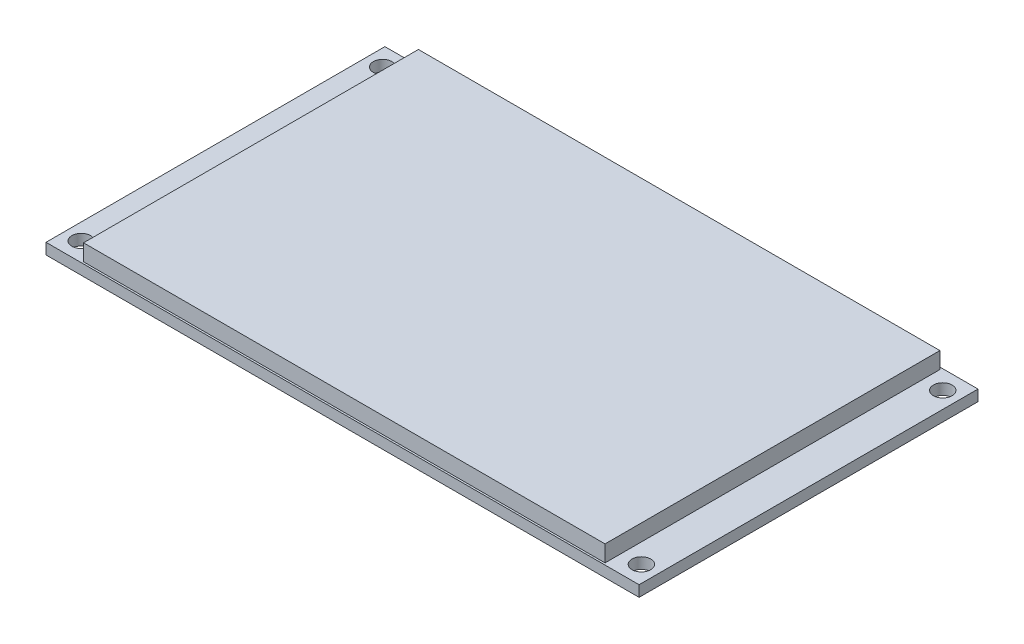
ISO-10303-21;
HEADER;
FILE_DESCRIPTION(('STEP AP214'),'2;1');
FILE_NAME('part.step','',(''),(''),'','','');
FILE_SCHEMA(('AUTOMOTIVE_DESIGN { 1 0 10303 214 1 1 1 1 }'));
ENDSEC;
DATA;
#1=APPLICATION_CONTEXT('core data for automotive mechanical design processes');
#2=APPLICATION_PROTOCOL_DEFINITION('international standard','automotive_design',2000,#1);
#3=PRODUCT_CONTEXT('',#1,'mechanical');
#4=PRODUCT('Part','Part','',(#3));
#5=PRODUCT_RELATED_PRODUCT_CATEGORY('part','',(#4));
#6=PRODUCT_DEFINITION_FORMATION('','',#4);
#7=PRODUCT_DEFINITION_CONTEXT('part definition',#1,'design');
#8=PRODUCT_DEFINITION('design','',#6,#7);
#9=PRODUCT_DEFINITION_SHAPE('','',#8);
#10=(LENGTH_UNIT() NAMED_UNIT(*) SI_UNIT(.MILLI.,.METRE.));
#11=(NAMED_UNIT(*) PLANE_ANGLE_UNIT() SI_UNIT($,.RADIAN.));
#12=(NAMED_UNIT(*) SI_UNIT($,.STERADIAN.) SOLID_ANGLE_UNIT());
#13=UNCERTAINTY_MEASURE_WITH_UNIT(LENGTH_MEASURE(1.E-05),#10,'distance_accuracy_value','');
#14=(GEOMETRIC_REPRESENTATION_CONTEXT(3) GLOBAL_UNCERTAINTY_ASSIGNED_CONTEXT((#13)) GLOBAL_UNIT_ASSIGNED_CONTEXT((#10,
#11,#12)) REPRESENTATION_CONTEXT('',''));
#15=CARTESIAN_POINT('',(0.,0.,0.));
#16=DIRECTION('',(0.,0.,1.));
#17=DIRECTION('',(1.,0.,0.));
#18=AXIS2_PLACEMENT_3D('',#15,#16,#17);
#19=CARTESIAN_POINT('',(54.02,2.,-30.87));
#20=DIRECTION('',(-1.,0.,0.));
#21=DIRECTION('',(0.,0.,1.));
#22=AXIS2_PLACEMENT_3D('',#19,#20,#21);
#23=PLANE('',#22);
#24=DIRECTION('',(0.,0.,-1.));
#25=VECTOR('',#24,1.);
#26=CARTESIAN_POINT('',(54.02,0.,-30.87));
#27=LINE('',#26,#25);
#28=CARTESIAN_POINT('',(54.02,0.,30.87));
#29=VERTEX_POINT('',#28);
#30=CARTESIAN_POINT('',(54.02,0.,-30.87));
#31=VERTEX_POINT('',#30);
#32=EDGE_CURVE('E122',#29,#31,#27,.T.);
#33=ORIENTED_EDGE('',*,*,#32,.T.);
#34=DIRECTION('',(0.,-1.,0.));
#35=VECTOR('',#34,1.);
#36=CARTESIAN_POINT('',(54.02,2.,-30.87));
#37=LINE('',#36,#35);
#38=CARTESIAN_POINT('',(54.02,2.,-30.87));
#39=VERTEX_POINT('',#38);
#40=EDGE_CURVE('E11',#39,#31,#37,.T.);
#41=ORIENTED_EDGE('',*,*,#40,.F.);
#42=DIRECTION('',(0.,0.,-1.));
#43=VECTOR('',#42,1.);
#44=CARTESIAN_POINT('',(54.02,2.,-30.87));
#45=LINE('',#44,#43);
#46=CARTESIAN_POINT('',(54.02,2.,30.87));
#47=VERTEX_POINT('',#46);
#48=EDGE_CURVE('E131',#47,#39,#45,.T.);
#49=ORIENTED_EDGE('',*,*,#48,.F.);
#50=DIRECTION('',(0.,-1.,0.));
#51=VECTOR('',#50,1.);
#52=CARTESIAN_POINT('',(54.02,2.,30.87));
#53=LINE('',#52,#51);
#54=EDGE_CURVE('E140',#47,#29,#53,.T.);
#55=ORIENTED_EDGE('',*,*,#54,.T.);
#56=EDGE_LOOP('',(#33,#41,#49,#55));
#57=FACE_BOUND('',#56,.T.);
#58=ADVANCED_FACE('F38',(#57),#23,.F.);
#59=CARTESIAN_POINT('',(-54.02,2.,-30.87));
#60=DIRECTION('',(0.,0.,1.));
#61=DIRECTION('',(1.,0.,0.));
#62=AXIS2_PLACEMENT_3D('',#59,#60,#61);
#63=PLANE('',#62);
#64=DIRECTION('',(-1.,0.,0.));
#65=VECTOR('',#64,1.);
#66=CARTESIAN_POINT('',(-54.02,0.,-30.87));
#67=LINE('',#66,#65);
#68=CARTESIAN_POINT('',(-54.02,0.,-30.87));
#69=VERTEX_POINT('',#68);
#70=EDGE_CURVE('E125',#31,#69,#67,.T.);
#71=ORIENTED_EDGE('',*,*,#70,.T.);
#72=DIRECTION('',(0.,-1.,0.));
#73=VECTOR('',#72,1.);
#74=CARTESIAN_POINT('',(-54.02,2.,-30.87));
#75=LINE('',#74,#73);
#76=CARTESIAN_POINT('',(-54.02,2.,-30.87));
#77=VERTEX_POINT('',#76);
#78=EDGE_CURVE('E45',#77,#69,#75,.T.);
#79=ORIENTED_EDGE('',*,*,#78,.F.);
#80=DIRECTION('',(-1.,0.,0.));
#81=VECTOR('',#80,1.);
#82=CARTESIAN_POINT('',(-54.02,2.,-30.87));
#83=LINE('',#82,#81);
#84=EDGE_CURVE('E134',#39,#77,#83,.T.);
#85=ORIENTED_EDGE('',*,*,#84,.F.);
#86=ORIENTED_EDGE('',*,*,#40,.T.);
#87=EDGE_LOOP('',(#71,#79,#85,#86));
#88=FACE_BOUND('',#87,.T.);
#89=ADVANCED_FACE('F171',(#88),#63,.F.);
#90=CARTESIAN_POINT('',(-54.02,2.,-30.87));
#91=DIRECTION('',(1.,0.,0.));
#92=DIRECTION('',(0.,0.,-1.));
#93=AXIS2_PLACEMENT_3D('',#90,#91,#92);
#94=PLANE('',#93);
#95=DIRECTION('',(0.,0.,1.));
#96=VECTOR('',#95,1.);
#97=CARTESIAN_POINT('',(-54.02,0.,-30.87));
#98=LINE('',#97,#96);
#99=CARTESIAN_POINT('',(-54.02,0.,30.87));
#100=VERTEX_POINT('',#99);
#101=EDGE_CURVE('E143',#69,#100,#98,.T.);
#102=ORIENTED_EDGE('',*,*,#101,.T.);
#103=DIRECTION('',(0.,-1.,0.));
#104=VECTOR('',#103,1.);
#105=CARTESIAN_POINT('',(-54.02,2.,30.87));
#106=LINE('',#105,#104);
#107=CARTESIAN_POINT('',(-54.02,2.,30.87));
#108=VERTEX_POINT('',#107);
#109=EDGE_CURVE('E148',#108,#100,#106,.T.);
#110=ORIENTED_EDGE('',*,*,#109,.F.);
#111=DIRECTION('',(0.,0.,1.));
#112=VECTOR('',#111,1.);
#113=CARTESIAN_POINT('',(-54.02,2.,-30.87));
#114=LINE('',#113,#112);
#115=EDGE_CURVE('E137',#77,#108,#114,.T.);
#116=ORIENTED_EDGE('',*,*,#115,.F.);
#117=ORIENTED_EDGE('',*,*,#78,.T.);
#118=EDGE_LOOP('',(#102,#110,#116,#117));
#119=FACE_BOUND('',#118,.T.);
#120=ADVANCED_FACE('F155',(#119),#94,.F.);
#121=CARTESIAN_POINT('',(-54.02,2.,30.87));
#122=DIRECTION('',(0.,0.,-1.));
#123=DIRECTION('',(-1.,0.,0.));
#124=AXIS2_PLACEMENT_3D('',#121,#122,#123);
#125=PLANE('',#124);
#126=DIRECTION('',(1.,0.,0.));
#127=VECTOR('',#126,1.);
#128=CARTESIAN_POINT('',(-54.02,0.,30.87));
#129=LINE('',#128,#127);
#130=EDGE_CURVE('E135',#100,#29,#129,.T.);
#131=ORIENTED_EDGE('',*,*,#130,.T.);
#132=ORIENTED_EDGE('',*,*,#54,.F.);
#133=DIRECTION('',(1.,0.,0.));
#134=VECTOR('',#133,1.);
#135=CARTESIAN_POINT('',(-54.02,2.,30.87));
#136=LINE('',#135,#134);
#137=EDGE_CURVE('E139',#108,#47,#136,.T.);
#138=ORIENTED_EDGE('',*,*,#137,.F.);
#139=ORIENTED_EDGE('',*,*,#109,.T.);
#140=EDGE_LOOP('',(#131,#132,#138,#139));
#141=FACE_BOUND('',#140,.T.);
#142=ADVANCED_FACE('F164',(#141),#125,.F.);
#143=CARTESIAN_POINT('',(0.,2.,0.));
#144=DIRECTION('',(0.,1.,0.));
#145=DIRECTION('',(0.,0.,1.));
#146=AXIS2_PLACEMENT_3D('',#143,#144,#145);
#147=PLANE('',#146);
#148=CARTESIAN_POINT('',(-51.02,2.,-27.45));
#149=DIRECTION('',(0.,1.,0.));
#150=DIRECTION('',(0.,0.,1.));
#151=AXIS2_PLACEMENT_3D('',#148,#149,#150);
#152=CIRCLE('',#151,1.69999999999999);
#153=CARTESIAN_POINT('',(-51.02,2.,-25.75));
#154=VERTEX_POINT('',#153);
#155=EDGE_CURVE('E224',#154,#154,#152,.T.);
#156=ORIENTED_EDGE('',*,*,#155,.F.);
#157=EDGE_LOOP('',(#156));
#158=FACE_BOUND('',#157,.T.);
#159=CARTESIAN_POINT('',(-51.02,2.,27.45));
#160=DIRECTION('',(0.,1.,0.));
#161=DIRECTION('',(0.,0.,1.));
#162=AXIS2_PLACEMENT_3D('',#159,#160,#161);
#163=CIRCLE('',#162,1.69999999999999);
#164=CARTESIAN_POINT('',(-51.02,2.,29.15));
#165=VERTEX_POINT('',#164);
#166=EDGE_CURVE('E226',#165,#165,#163,.T.);
#167=ORIENTED_EDGE('',*,*,#166,.F.);
#168=EDGE_LOOP('',(#167));
#169=FACE_BOUND('',#168,.T.);
#170=CARTESIAN_POINT('',(51.02,2.,-27.45));
#171=DIRECTION('',(0.,1.,0.));
#172=DIRECTION('',(0.,0.,1.));
#173=AXIS2_PLACEMENT_3D('',#170,#171,#172);
#174=CIRCLE('',#173,1.69999999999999);
#175=CARTESIAN_POINT('',(51.02,2.,-25.75));
#176=VERTEX_POINT('',#175);
#177=EDGE_CURVE('E234',#176,#176,#174,.T.);
#178=ORIENTED_EDGE('',*,*,#177,.F.);
#179=EDGE_LOOP('',(#178));
#180=FACE_BOUND('',#179,.T.);
#181=CARTESIAN_POINT('',(51.02,2.,27.45));
#182=DIRECTION('',(0.,1.,0.));
#183=DIRECTION('',(0.,0.,1.));
#184=AXIS2_PLACEMENT_3D('',#181,#182,#183);
#185=CIRCLE('',#184,1.69999999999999);
#186=CARTESIAN_POINT('',(51.02,2.,29.15));
#187=VERTEX_POINT('',#186);
#188=EDGE_CURVE('E240',#187,#187,#185,.T.);
#189=ORIENTED_EDGE('',*,*,#188,.F.);
#190=EDGE_LOOP('',(#189));
#191=FACE_BOUND('',#190,.T.);
#192=DIRECTION('',(0.,0.,-1.));
#193=VECTOR('',#192,1.);
#194=CARTESIAN_POINT('',(47.48,2.,-30.47));
#195=LINE('',#194,#193);
#196=CARTESIAN_POINT('',(47.48,2.,30.53));
#197=VERTEX_POINT('',#196);
#198=CARTESIAN_POINT('',(47.48,2.,-30.47));
#199=VERTEX_POINT('',#198);
#200=EDGE_CURVE('E52',#197,#199,#195,.T.);
#201=ORIENTED_EDGE('',*,*,#200,.F.);
#202=DIRECTION('',(1.,0.,0.));
#203=VECTOR('',#202,1.);
#204=CARTESIAN_POINT('',(-47.52,2.,30.53));
#205=LINE('',#204,#203);
#206=CARTESIAN_POINT('',(-47.52,2.,30.53));
#207=VERTEX_POINT('',#206);
#208=EDGE_CURVE('E56',#207,#197,#205,.T.);
#209=ORIENTED_EDGE('',*,*,#208,.F.);
#210=DIRECTION('',(0.,0.,1.));
#211=VECTOR('',#210,1.);
#212=CARTESIAN_POINT('',(-47.52,2.,-30.47));
#213=LINE('',#212,#211);
#214=CARTESIAN_POINT('',(-47.52,2.,-30.47));
#215=VERTEX_POINT('',#214);
#216=EDGE_CURVE('E252',#215,#207,#213,.T.);
#217=ORIENTED_EDGE('',*,*,#216,.F.);
#218=DIRECTION('',(-1.,0.,0.));
#219=VECTOR('',#218,1.);
#220=CARTESIAN_POINT('',(-47.52,2.,-30.47));
#221=LINE('',#220,#219);
#222=EDGE_CURVE('E250',#199,#215,#221,.T.);
#223=ORIENTED_EDGE('',*,*,#222,.F.);
#224=EDGE_LOOP('',(#201,#209,#217,#223));
#225=FACE_BOUND('',#224,.T.);
#226=ORIENTED_EDGE('',*,*,#48,.T.);
#227=ORIENTED_EDGE('',*,*,#84,.T.);
#228=ORIENTED_EDGE('',*,*,#115,.T.);
#229=ORIENTED_EDGE('',*,*,#137,.T.);
#230=EDGE_LOOP('',(#226,#227,#228,#229));
#231=FACE_BOUND('',#230,.T.);
#232=ADVANCED_FACE('F170',(#158,#169,#180,#191,#225,#231),#147,.T.);
#233=CARTESIAN_POINT('',(0.,0.,0.));
#234=DIRECTION('',(0.,1.,0.));
#235=DIRECTION('',(0.,0.,1.));
#236=AXIS2_PLACEMENT_3D('',#233,#234,#235);
#237=PLANE('',#236);
#238=CARTESIAN_POINT('',(-51.02,0.,-27.45));
#239=DIRECTION('',(0.,1.,0.));
#240=DIRECTION('',(0.,0.,1.));
#241=AXIS2_PLACEMENT_3D('',#238,#239,#240);
#242=CIRCLE('',#241,1.69999999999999);
#243=CARTESIAN_POINT('',(-51.02,0.,-25.75));
#244=VERTEX_POINT('',#243);
#245=EDGE_CURVE('E221',#244,#244,#242,.T.);
#246=ORIENTED_EDGE('',*,*,#245,.T.);
#247=EDGE_LOOP('',(#246));
#248=FACE_BOUND('',#247,.T.);
#249=CARTESIAN_POINT('',(-51.02,0.,27.45));
#250=DIRECTION('',(0.,1.,0.));
#251=DIRECTION('',(0.,0.,1.));
#252=AXIS2_PLACEMENT_3D('',#249,#250,#251);
#253=CIRCLE('',#252,1.69999999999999);
#254=CARTESIAN_POINT('',(-51.02,0.,29.15));
#255=VERTEX_POINT('',#254);
#256=EDGE_CURVE('E231',#255,#255,#253,.T.);
#257=ORIENTED_EDGE('',*,*,#256,.T.);
#258=EDGE_LOOP('',(#257));
#259=FACE_BOUND('',#258,.T.);
#260=CARTESIAN_POINT('',(51.02,0.,-27.45));
#261=DIRECTION('',(0.,1.,0.));
#262=DIRECTION('',(0.,0.,1.));
#263=AXIS2_PLACEMENT_3D('',#260,#261,#262);
#264=CIRCLE('',#263,1.69999999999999);
#265=CARTESIAN_POINT('',(51.02,0.,-25.75));
#266=VERTEX_POINT('',#265);
#267=EDGE_CURVE('E237',#266,#266,#264,.T.);
#268=ORIENTED_EDGE('',*,*,#267,.T.);
#269=EDGE_LOOP('',(#268));
#270=FACE_BOUND('',#269,.T.);
#271=CARTESIAN_POINT('',(51.02,0.,27.45));
#272=DIRECTION('',(0.,1.,0.));
#273=DIRECTION('',(0.,0.,1.));
#274=AXIS2_PLACEMENT_3D('',#271,#272,#273);
#275=CIRCLE('',#274,1.69999999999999);
#276=CARTESIAN_POINT('',(51.02,0.,29.15));
#277=VERTEX_POINT('',#276);
#278=EDGE_CURVE('E243',#277,#277,#275,.T.);
#279=ORIENTED_EDGE('',*,*,#278,.T.);
#280=EDGE_LOOP('',(#279));
#281=FACE_BOUND('',#280,.T.);
#282=ORIENTED_EDGE('',*,*,#32,.F.);
#283=ORIENTED_EDGE('',*,*,#130,.F.);
#284=ORIENTED_EDGE('',*,*,#101,.F.);
#285=ORIENTED_EDGE('',*,*,#70,.F.);
#286=EDGE_LOOP('',(#282,#283,#284,#285));
#287=FACE_BOUND('',#286,.T.);
#288=ADVANCED_FACE('F161',(#248,#259,#270,#281,#287),#237,.F.);
#289=CARTESIAN_POINT('',(47.48,5.,-30.47));
#290=DIRECTION('',(-1.,0.,0.));
#291=DIRECTION('',(0.,0.,1.));
#292=AXIS2_PLACEMENT_3D('',#289,#290,#291);
#293=PLANE('',#292);
#294=ORIENTED_EDGE('',*,*,#200,.T.);
#295=DIRECTION('',(0.,-1.,0.));
#296=VECTOR('',#295,1.);
#297=CARTESIAN_POINT('',(47.48,5.,-30.47));
#298=LINE('',#297,#296);
#299=CARTESIAN_POINT('',(47.48,5.,-30.47));
#300=VERTEX_POINT('',#299);
#301=EDGE_CURVE('E105',#300,#199,#298,.T.);
#302=ORIENTED_EDGE('',*,*,#301,.F.);
#303=DIRECTION('',(0.,0.,-1.));
#304=VECTOR('',#303,1.);
#305=CARTESIAN_POINT('',(47.48,5.,-30.47));
#306=LINE('',#305,#304);
#307=CARTESIAN_POINT('',(47.48,5.,30.53));
#308=VERTEX_POINT('',#307);
#309=EDGE_CURVE('E111',#308,#300,#306,.T.);
#310=ORIENTED_EDGE('',*,*,#309,.F.);
#311=DIRECTION('',(0.,-1.,0.));
#312=VECTOR('',#311,1.);
#313=CARTESIAN_POINT('',(47.48,5.,30.53));
#314=LINE('',#313,#312);
#315=EDGE_CURVE('E248',#308,#197,#314,.T.);
#316=ORIENTED_EDGE('',*,*,#315,.T.);
#317=EDGE_LOOP('',(#294,#302,#310,#316));
#318=FACE_BOUND('',#317,.T.);
#319=ADVANCED_FACE('F121',(#318),#293,.F.);
#320=CARTESIAN_POINT('',(-47.52,5.,-30.47));
#321=DIRECTION('',(0.,0.,1.));
#322=DIRECTION('',(1.,0.,0.));
#323=AXIS2_PLACEMENT_3D('',#320,#321,#322);
#324=PLANE('',#323);
#325=ORIENTED_EDGE('',*,*,#222,.T.);
#326=DIRECTION('',(0.,-1.,0.));
#327=VECTOR('',#326,1.);
#328=CARTESIAN_POINT('',(-47.52,5.,-30.47));
#329=LINE('',#328,#327);
#330=CARTESIAN_POINT('',(-47.52,5.,-30.47));
#331=VERTEX_POINT('',#330);
#332=EDGE_CURVE('E107',#331,#215,#329,.T.);
#333=ORIENTED_EDGE('',*,*,#332,.F.);
#334=DIRECTION('',(-1.,0.,0.));
#335=VECTOR('',#334,1.);
#336=CARTESIAN_POINT('',(-47.52,5.,-30.47));
#337=LINE('',#336,#335);
#338=EDGE_CURVE('E100',#300,#331,#337,.T.);
#339=ORIENTED_EDGE('',*,*,#338,.F.);
#340=ORIENTED_EDGE('',*,*,#301,.T.);
#341=EDGE_LOOP('',(#325,#333,#339,#340));
#342=FACE_BOUND('',#341,.T.);
#343=ADVANCED_FACE('F103',(#342),#324,.F.);
#344=CARTESIAN_POINT('',(-47.52,5.,-30.47));
#345=DIRECTION('',(1.,0.,0.));
#346=DIRECTION('',(0.,0.,-1.));
#347=AXIS2_PLACEMENT_3D('',#344,#345,#346);
#348=PLANE('',#347);
#349=ORIENTED_EDGE('',*,*,#216,.T.);
#350=DIRECTION('',(0.,-1.,0.));
#351=VECTOR('',#350,1.);
#352=CARTESIAN_POINT('',(-47.52,5.,30.53));
#353=LINE('',#352,#351);
#354=CARTESIAN_POINT('',(-47.52,5.,30.53));
#355=VERTEX_POINT('',#354);
#356=EDGE_CURVE('E127',#355,#207,#353,.T.);
#357=ORIENTED_EDGE('',*,*,#356,.F.);
#358=DIRECTION('',(0.,0.,1.));
#359=VECTOR('',#358,1.);
#360=CARTESIAN_POINT('',(-47.52,5.,-30.47));
#361=LINE('',#360,#359);
#362=EDGE_CURVE('E110',#331,#355,#361,.T.);
#363=ORIENTED_EDGE('',*,*,#362,.F.);
#364=ORIENTED_EDGE('',*,*,#332,.T.);
#365=EDGE_LOOP('',(#349,#357,#363,#364));
#366=FACE_BOUND('',#365,.T.);
#367=ADVANCED_FACE('F191',(#366),#348,.F.);
#368=CARTESIAN_POINT('',(-47.52,5.,30.53));
#369=DIRECTION('',(0.,0.,-1.));
#370=DIRECTION('',(-1.,0.,0.));
#371=AXIS2_PLACEMENT_3D('',#368,#369,#370);
#372=PLANE('',#371);
#373=ORIENTED_EDGE('',*,*,#208,.T.);
#374=ORIENTED_EDGE('',*,*,#315,.F.);
#375=DIRECTION('',(1.,0.,0.));
#376=VECTOR('',#375,1.);
#377=CARTESIAN_POINT('',(-47.52,5.,30.53));
#378=LINE('',#377,#376);
#379=EDGE_CURVE('E116',#355,#308,#378,.T.);
#380=ORIENTED_EDGE('',*,*,#379,.F.);
#381=ORIENTED_EDGE('',*,*,#356,.T.);
#382=EDGE_LOOP('',(#373,#374,#380,#381));
#383=FACE_BOUND('',#382,.T.);
#384=ADVANCED_FACE('F194',(#383),#372,.F.);
#385=CARTESIAN_POINT('',(0.,5.,0.));
#386=DIRECTION('',(0.,1.,0.));
#387=DIRECTION('',(0.,0.,1.));
#388=AXIS2_PLACEMENT_3D('',#385,#386,#387);
#389=PLANE('',#388);
#390=ORIENTED_EDGE('',*,*,#309,.T.);
#391=ORIENTED_EDGE('',*,*,#338,.T.);
#392=ORIENTED_EDGE('',*,*,#362,.T.);
#393=ORIENTED_EDGE('',*,*,#379,.T.);
#394=EDGE_LOOP('',(#390,#391,#392,#393));
#395=FACE_BOUND('',#394,.T.);
#396=ADVANCED_FACE('F114',(#395),#389,.T.);
#397=CARTESIAN_POINT('',(51.02,2.,27.45));
#398=DIRECTION('',(0.,1.,0.));
#399=DIRECTION('',(0.,0.,1.));
#400=AXIS2_PLACEMENT_3D('',#397,#398,#399);
#401=CYLINDRICAL_SURFACE('',#400,1.69999999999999);
#402=ORIENTED_EDGE('',*,*,#278,.F.);
#403=EDGE_LOOP('',(#402));
#404=FACE_BOUND('',#403,.T.);
#405=ORIENTED_EDGE('',*,*,#188,.T.);
#406=EDGE_LOOP('',(#405));
#407=FACE_BOUND('',#406,.T.);
#408=ADVANCED_FACE('F201',(#404,#407),#401,.F.);
#409=CARTESIAN_POINT('',(51.02,2.,-27.45));
#410=DIRECTION('',(0.,1.,0.));
#411=DIRECTION('',(0.,0.,1.));
#412=AXIS2_PLACEMENT_3D('',#409,#410,#411);
#413=CYLINDRICAL_SURFACE('',#412,1.69999999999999);
#414=ORIENTED_EDGE('',*,*,#267,.F.);
#415=EDGE_LOOP('',(#414));
#416=FACE_BOUND('',#415,.T.);
#417=ORIENTED_EDGE('',*,*,#177,.T.);
#418=EDGE_LOOP('',(#417));
#419=FACE_BOUND('',#418,.T.);
#420=ADVANCED_FACE('F204',(#416,#419),#413,.F.);
#421=CARTESIAN_POINT('',(-51.02,2.,27.45));
#422=DIRECTION('',(0.,1.,0.));
#423=DIRECTION('',(0.,0.,1.));
#424=AXIS2_PLACEMENT_3D('',#421,#422,#423);
#425=CYLINDRICAL_SURFACE('',#424,1.69999999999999);
#426=ORIENTED_EDGE('',*,*,#256,.F.);
#427=EDGE_LOOP('',(#426));
#428=FACE_BOUND('',#427,.T.);
#429=ORIENTED_EDGE('',*,*,#166,.T.);
#430=EDGE_LOOP('',(#429));
#431=FACE_BOUND('',#430,.T.);
#432=ADVANCED_FACE('F208',(#428,#431),#425,.F.);
#433=CARTESIAN_POINT('',(-51.02,2.,-27.45));
#434=DIRECTION('',(0.,1.,0.));
#435=DIRECTION('',(0.,0.,1.));
#436=AXIS2_PLACEMENT_3D('',#433,#434,#435);
#437=CYLINDRICAL_SURFACE('',#436,1.69999999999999);
#438=ORIENTED_EDGE('',*,*,#245,.F.);
#439=EDGE_LOOP('',(#438));
#440=FACE_BOUND('',#439,.T.);
#441=ORIENTED_EDGE('',*,*,#155,.T.);
#442=EDGE_LOOP('',(#441));
#443=FACE_BOUND('',#442,.T.);
#444=ADVANCED_FACE('F212',(#440,#443),#437,.F.);
#445=CLOSED_SHELL('',(#58,#89,#120,#142,#232,#288,#319,#343,#367,#384,#396,#408,#420,#432,#444));
#446=MANIFOLD_SOLID_BREP('B2',#445);
#447=ADVANCED_BREP_SHAPE_REPRESENTATION('',(#18,#446),#14);
#448=SHAPE_DEFINITION_REPRESENTATION(#9,#447);
ENDSEC;
END-ISO-10303-21;
